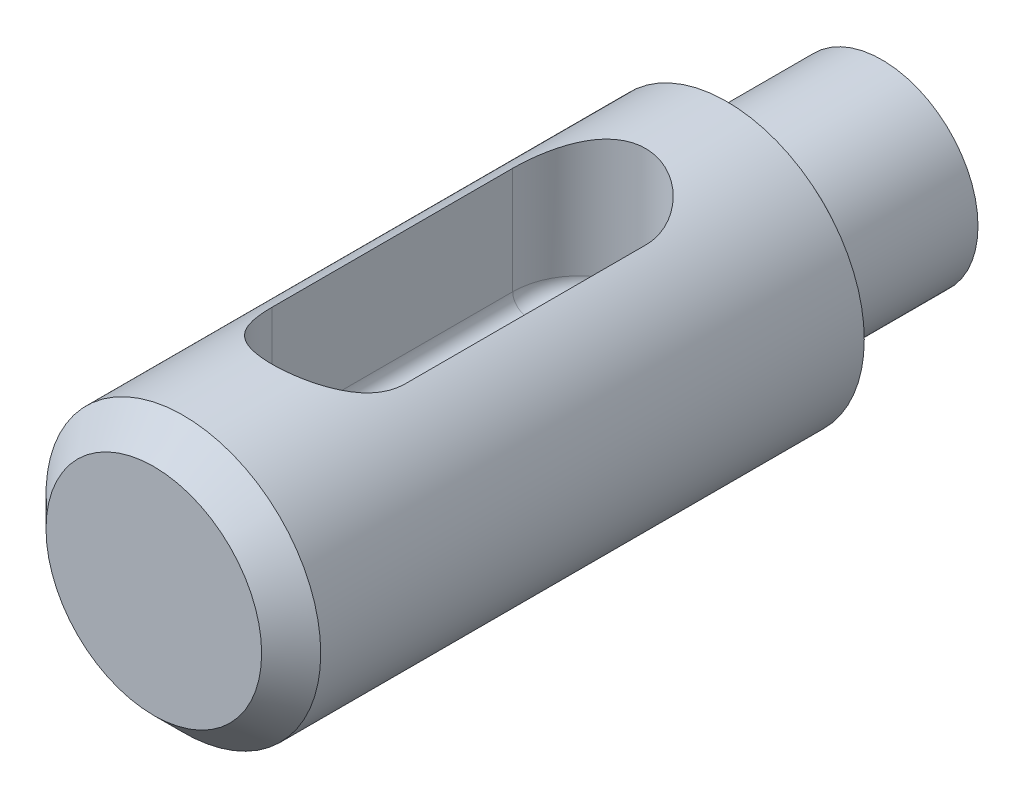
from build123d import *

# Parameters (mm, degrees)
CUT_EXTRUDE1_REACH             = 14.96
CUT_EXTRUDE1_END_RADIUS        = 2.3622
CUT_EXTRUDE1_DIRECTION_2_DEPTH = 0.0254
FILLET1_R                      = 0.254


with BuildPart() as part:
    # Sketch1 → Revolve1 (revolve)
    with BuildSketch(Plane(origin=(0, 0, 0), x_dir=(1, 0, 0), z_dir=(0, 1, 0)), mode=Mode.PRIVATE) as revolve1_sk:
        with BuildLine():
            Line((0, 0), (0, 12.5222))
            Line((0, 12.5222), (-1.651, 12.5222))
            Line((-1.651, 12.5222), (-1.651, 10.3632))
            ThreePointArc((-1.651, 10.3632), (-1.799789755, 10.003989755), (-2.159, 9.8552))
            Line((-2.159, 9.8552), (-2.3622, 9.8552))
            Line((-2.3622, 9.8552), (-2.3622, 0.508))
            Line((-2.3622, 0.508), (-1.8542, 0))
            Line((-1.8542, 0), (0, 0))
        make_face()
    revolve(revolve1_sk.sketch.rotate(Axis((0, 0, 0), (0, 0, -1)), 180), axis=Axis((0, 0, 0), (0, 0, -1)))

    # Cut-Extrude1: up to this cylinder (the profile starts inside it)
    cut_extrude1_end = Plane(origin=(0, 0, -5.2451), z_dir=(0, 0, 1)) * Cylinder(CUT_EXTRUDE1_END_RADIUS, 35.6444, mode=Mode.PRIVATE)
    # Sketch2 → Cut-Extrude1 (cut, up to the surface)
    with BuildSketch(Plane(origin=(0, 0, 0), x_dir=(1, 0, 0), z_dir=(0, 1, 0)), mode=Mode.PRIVATE) as cut_extrude1_sk1:
        with BuildLine():
            Line((-1.143, 3.175), (-1.143, 7.3152))
            ThreePointArc((-1.143, 7.3152), (0, 8.4582), (1.143, 7.3152))
            Line((1.143, 7.3152), (1.143, 3.175))
            ThreePointArc((1.143, 3.175), (0, 2.032), (-1.143, 3.175))
        make_face()
    cut_extrude1_tool1 = extrude(cut_extrude1_sk1.sketch, amount=CUT_EXTRUDE1_REACH, mode=Mode.PRIVATE) & cut_extrude1_end
    add(cut_extrude1_tool1.solids().sort_by_distance((0, 0, -5.2451))[0], mode=Mode.SUBTRACT)

    # Sketch2 → Cut-Extrude1 direction 2 (cut)
    with BuildSketch(Plane(origin=(0, 0, 0), x_dir=(1, 0, 0), z_dir=(0, 1, 0))):
        with BuildLine():
            Line((-1.143, 3.175), (-1.143, 7.3152))
            ThreePointArc((-1.143, 7.3152), (0, 8.4582), (1.143, 7.3152))
            Line((1.143, 7.3152), (1.143, 3.175))
            ThreePointArc((1.143, 3.175), (0, 2.032), (-1.143, 3.175))
        make_face()
    extrude(amount=-CUT_EXTRUDE1_DIRECTION_2_DEPTH, mode=Mode.SUBTRACT)

    # Fillet1
    fillet1_edges = [part.edges().sort_by_distance(p)[0] for p in [
        (0, -0.0254, -2.032),
        (-1.143, -0.0254, -5.2451),
        (0, -0.0254, -8.4582),
        (1.143, -0.0254, -5.2451),
    ]]
    fillet(fillet1_edges, radius=FILLET1_R)


solid = part.part
